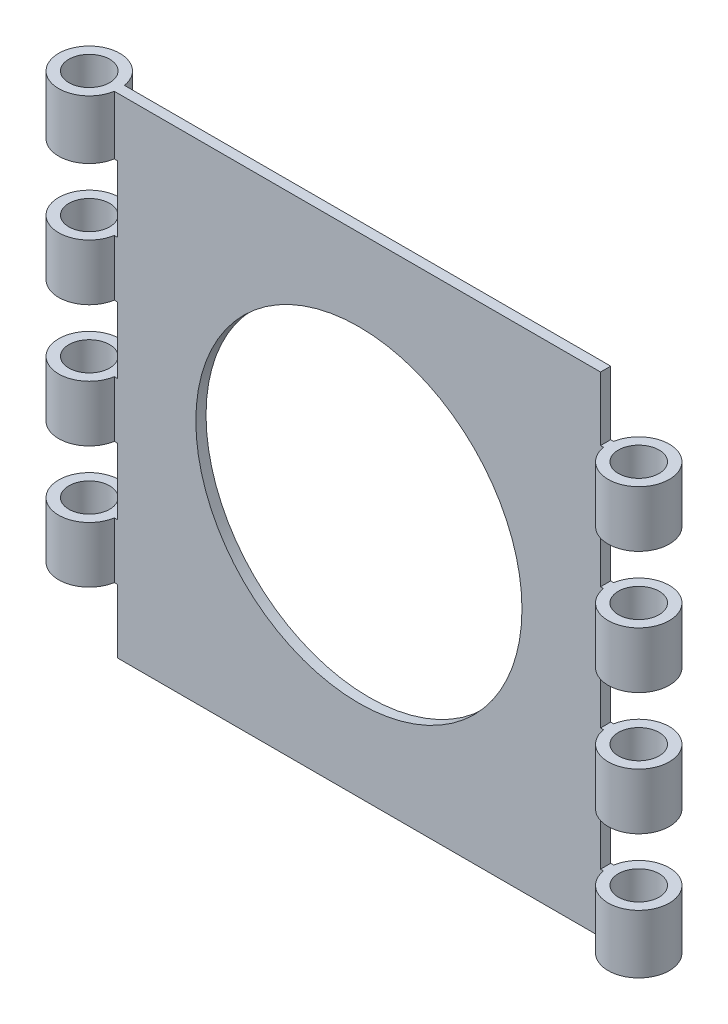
from build123d import *

# Parameters (mm, degrees)
SKETCH1_W                   = 76.2
SKETCH1_H                   = 76.2
BASE_EXTRUDE_DEPTH          = 1.5875
SKETCH2_R                   = 4.7625
BOSS_EXTRUDE2_DEPTH         = 76.2
SKETCH4_R                   = 4.7625
BOSS_EXTRUDE4_DEPTH         = 76.2
SKETCH5_R                   = 25.4
CUT_EXTRUDE1_DEPTH          = 115.780971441
SKETCH7_R                   = 3.175
CUT_EXTRUDE3_DEPTH          = 115.780971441
SKETCH9_R                   = 3.175
CUT_EXTRUDE5_DEPTH          = 115.780971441
SKETCH10_W                  = 10.31875
SKETCH10_H                  = 10.31875
CUT_EXTRUDE9_DEPTH          = 115.780971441
LPATTERN1_COUNT             = 4
LPATTERN1_PITCH             = 19.05
CIRPATTERN2_COUNT           = 2
CIRPATTERN2_COPY_1_SKETCH_W = 10.31875
CIRPATTERN2_COPY_1_SKETCH_H = 10.31875
CIRPATTERN2_COPY_1_DEPTH    = 115.780971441
CIRPATTERN2_COPY_2_SKETCH_W = 10.31875
CIRPATTERN2_COPY_2_SKETCH_H = 10.31875
CIRPATTERN2_COPY_2_DEPTH    = 115.780971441
CIRPATTERN2_COPY_3_SKETCH_W = 10.31875
CIRPATTERN2_COPY_3_SKETCH_H = 10.31875
CIRPATTERN2_COPY_3_DEPTH    = 115.780971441


with BuildPart() as part:
    # Sketch1 → Base-Extrude (new body)
    with BuildSketch(Plane.XY):
        with Locations((38.1, 38.1)):
            Rectangle(SKETCH1_W, SKETCH1_H)
    extrude(amount=BASE_EXTRUDE_DEPTH)

    # Sketch2 → Boss-Extrude2 (add)
    with BuildSketch(Plane(origin=(0, 76.2, 0), x_dir=(-1, 0, 0), z_dir=(0, 1, 0))):
        with Locations((-80.895888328, 0.79375)):
            Circle(SKETCH2_R)
    extrude(amount=-BOSS_EXTRUDE2_DEPTH)

    # Sketch4 → Boss-Extrude4 (add)
    with BuildSketch(Plane(origin=(82.432904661, 0, -0.487855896), x_dir=(1, 0, 0), z_dir=(0, -1, 0))):
        with Locations((-87.128792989, 1.281605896)):
            Circle(SKETCH4_R)
    extrude(amount=-BOSS_EXTRUDE4_DEPTH)

    # Sketch5 → Cut-Extrude1 (cut, through all)
    with BuildSketch(Plane(origin=(0, 0, 0), x_dir=(-1, 0, 0), z_dir=(0, 0, -1))):
        with Locations((-38.1, 38.1)):
            Circle(SKETCH5_R)
    extrude(amount=-CUT_EXTRUDE1_DEPTH, mode=Mode.SUBTRACT)

    # Sketch7 → Cut-Extrude3 (cut, through all)
    with BuildSketch(Plane.XZ):
        with Locations(Location((80.895888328, 0.79375, 0), (0, 0, 270))):
            Circle(SKETCH7_R)
    extrude(amount=-CUT_EXTRUDE3_DEPTH, mode=Mode.SUBTRACT)

    # Sketch9 → Cut-Extrude5 (cut, through all)
    with BuildSketch(Plane.XZ):
        with Locations(Location((-4.695888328, 0.79375, 0), (0, 0, 270))):
            Circle(SKETCH9_R)
    extrude(amount=-CUT_EXTRUDE5_DEPTH, mode=Mode.SUBTRACT)

    # Sketch10 → Cut-Extrude9 (cut, symmetric)
    with BuildSketch(Plane.XY.offset(1.5875)):
        with Locations((80.895888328, 71.4375)):
            Rectangle(SKETCH10_W, SKETCH10_H)
    cut_extrude9 = extrude(amount=CUT_EXTRUDE9_DEPTH, both=True, mode=Mode.SUBTRACT)

    # LPattern1: Cut-Extrude9 ×4
    with Locations(*[(0, -i * LPATTERN1_PITCH, 0) for i in range(1, LPATTERN1_COUNT)]):
        add(cut_extrude9, mode=Mode.SUBTRACT)

    # CirPattern2: Cut-Extrude9 ×2 about axis
    cirpattern2_axis = Axis((38.1, 38.1, 0), (0, 0, 1))
    for i in range(1, CIRPATTERN2_COUNT):
        add(cut_extrude9.rotate(cirpattern2_axis, i * 360 / CIRPATTERN2_COUNT), mode=Mode.SUBTRACT)

    # CirPattern2 copy 1 sketch → CirPattern2 copy 1 (cut, symmetric)
    with BuildSketch(Plane(origin=(76.2, 95.25, 1.5875), x_dir=(-1, 0, 0), z_dir=(0, 0, 1))):
        with Locations((80.895888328, 71.4375)):
            Rectangle(CIRPATTERN2_COPY_1_SKETCH_W, CIRPATTERN2_COPY_1_SKETCH_H)
    extrude(amount=CIRPATTERN2_COPY_1_DEPTH, both=True, mode=Mode.SUBTRACT)

    # CirPattern2 copy 2 sketch → CirPattern2 copy 2 (cut, symmetric)
    with BuildSketch(Plane(origin=(76.2, 114.3, 1.5875), x_dir=(-1, 0, 0), z_dir=(0, 0, 1))):
        with Locations((80.895888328, 71.4375)):
            Rectangle(CIRPATTERN2_COPY_2_SKETCH_W, CIRPATTERN2_COPY_2_SKETCH_H)
    extrude(amount=CIRPATTERN2_COPY_2_DEPTH, both=True, mode=Mode.SUBTRACT)

    # CirPattern2 copy 3 sketch → CirPattern2 copy 3 (cut, symmetric)
    with BuildSketch(Plane(origin=(76.2, 133.35, 1.5875), x_dir=(-1, 0, 0), z_dir=(0, 0, 1))):
        with Locations((80.895888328, 71.4375)):
            Rectangle(CIRPATTERN2_COPY_3_SKETCH_W, CIRPATTERN2_COPY_3_SKETCH_H)
    extrude(amount=CIRPATTERN2_COPY_3_DEPTH, both=True, mode=Mode.SUBTRACT)


solid = part.part
